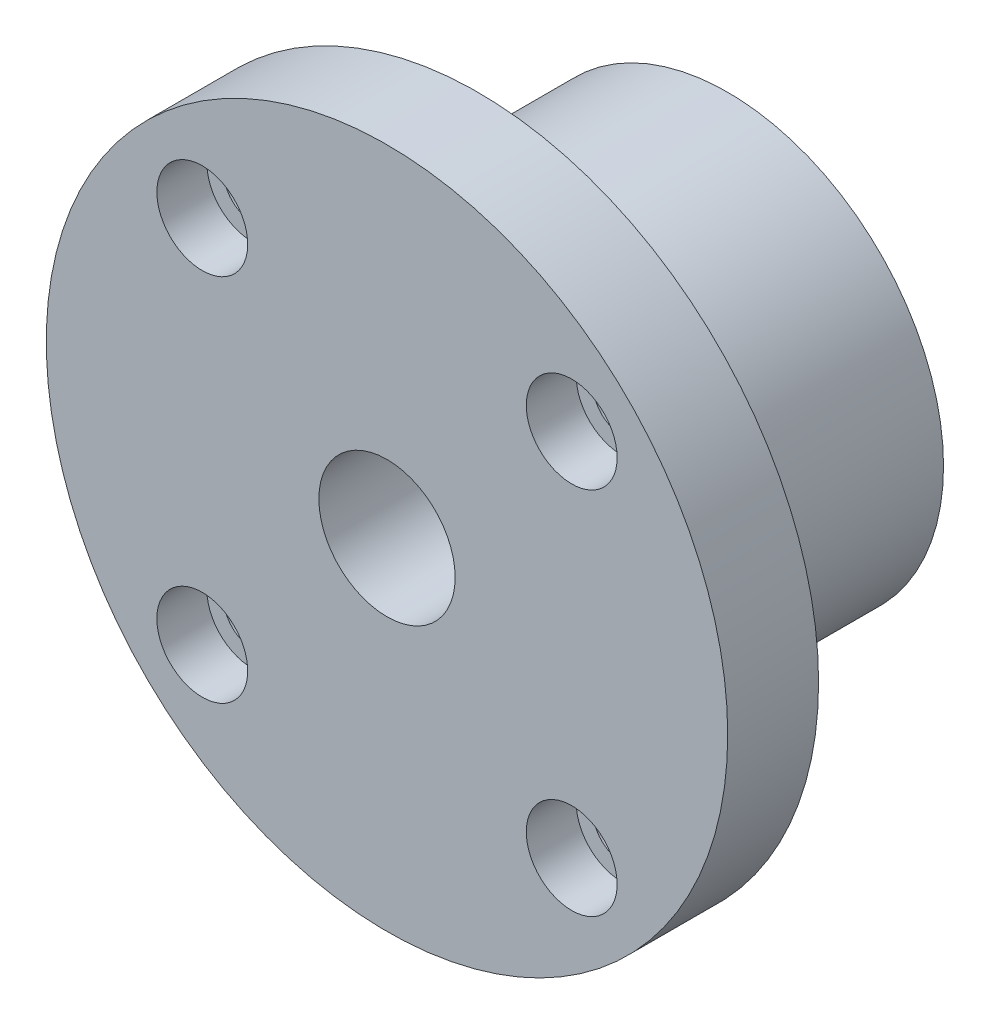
ISO-10303-21;
HEADER;
FILE_DESCRIPTION(('STEP AP214'),'2;1');
FILE_NAME('part.step','',(''),(''),'','','');
FILE_SCHEMA(('AUTOMOTIVE_DESIGN { 1 0 10303 214 1 1 1 1 }'));
ENDSEC;
DATA;
#1=APPLICATION_CONTEXT('core data for automotive mechanical design processes');
#2=APPLICATION_PROTOCOL_DEFINITION('international standard','automotive_design',2000,#1);
#3=PRODUCT_CONTEXT('',#1,'mechanical');
#4=PRODUCT('Part','Part','',(#3));
#5=PRODUCT_RELATED_PRODUCT_CATEGORY('part','',(#4));
#6=PRODUCT_DEFINITION_FORMATION('','',#4);
#7=PRODUCT_DEFINITION_CONTEXT('part definition',#1,'design');
#8=PRODUCT_DEFINITION('design','',#6,#7);
#9=PRODUCT_DEFINITION_SHAPE('','',#8);
#10=(LENGTH_UNIT() NAMED_UNIT(*) SI_UNIT(.MILLI.,.METRE.));
#11=(NAMED_UNIT(*) PLANE_ANGLE_UNIT() SI_UNIT($,.RADIAN.));
#12=(NAMED_UNIT(*) SI_UNIT($,.STERADIAN.) SOLID_ANGLE_UNIT());
#13=UNCERTAINTY_MEASURE_WITH_UNIT(LENGTH_MEASURE(1.E-05),#10,'distance_accuracy_value','');
#14=(GEOMETRIC_REPRESENTATION_CONTEXT(3) GLOBAL_UNCERTAINTY_ASSIGNED_CONTEXT((#13)) GLOBAL_UNIT_ASSIGNED_CONTEXT((#10,
#11,#12)) REPRESENTATION_CONTEXT('',''));
#15=CARTESIAN_POINT('',(0.,0.,0.));
#16=DIRECTION('',(0.,0.,1.));
#17=DIRECTION('',(1.,0.,0.));
#18=AXIS2_PLACEMENT_3D('',#15,#16,#17);
#19=CARTESIAN_POINT('',(0.,0.,0.));
#20=DIRECTION('',(0.,0.,1.));
#21=DIRECTION('',(1.,0.,0.));
#22=AXIS2_PLACEMENT_3D('',#19,#20,#21);
#23=PLANE('',#22);
#24=CARTESIAN_POINT('',(0.,0.,0.));
#25=DIRECTION('',(0.,0.,1.));
#26=DIRECTION('',(1.,0.,0.));
#27=AXIS2_PLACEMENT_3D('',#24,#25,#26);
#28=CIRCLE('',#27,30.);
#29=CARTESIAN_POINT('',(30.,0.,0.));
#30=VERTEX_POINT('',#29);
#31=EDGE_CURVE('E25',#30,#30,#28,.T.);
#32=ORIENTED_EDGE('',*,*,#31,.F.);
#33=EDGE_LOOP('',(#32));
#34=FACE_BOUND('',#33,.T.);
#35=CARTESIAN_POINT('',(16.2634559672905,16.2634559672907,0.));
#36=DIRECTION('',(0.,0.,1.));
#37=DIRECTION('',(1.,0.,0.));
#38=AXIS2_PLACEMENT_3D('',#35,#36,#37);
#39=CIRCLE('',#38,2.5);
#40=CARTESIAN_POINT('',(18.7634559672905,16.2634559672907,0.));
#41=VERTEX_POINT('',#40);
#42=EDGE_CURVE('E67',#41,#41,#39,.T.);
#43=ORIENTED_EDGE('',*,*,#42,.T.);
#44=EDGE_LOOP('',(#43));
#45=FACE_BOUND('',#44,.T.);
#46=CARTESIAN_POINT('',(16.2634559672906,-16.2634559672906,0.));
#47=DIRECTION('',(0.,0.,1.));
#48=DIRECTION('',(0.,-1.,0.));
#49=AXIS2_PLACEMENT_3D('',#46,#47,#48);
#50=CIRCLE('',#49,2.5);
#51=CARTESIAN_POINT('',(16.2634559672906,-18.7634559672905,0.));
#52=VERTEX_POINT('',#51);
#53=EDGE_CURVE('E57',#52,#52,#50,.T.);
#54=ORIENTED_EDGE('',*,*,#53,.T.);
#55=EDGE_LOOP('',(#54));
#56=FACE_BOUND('',#55,.T.);
#57=CARTESIAN_POINT('',(-16.2634559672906,-16.2634559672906,0.));
#58=DIRECTION('',(0.,0.,1.));
#59=DIRECTION('',(-1.,0.,0.));
#60=AXIS2_PLACEMENT_3D('',#57,#58,#59);
#61=CIRCLE('',#60,2.5);
#62=CARTESIAN_POINT('',(-18.7634559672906,-16.2634559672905,0.));
#63=VERTEX_POINT('',#62);
#64=EDGE_CURVE('E54',#63,#63,#61,.T.);
#65=ORIENTED_EDGE('',*,*,#64,.T.);
#66=EDGE_LOOP('',(#65));
#67=FACE_BOUND('',#66,.T.);
#68=CARTESIAN_POINT('',(-16.2634559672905,16.2634559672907,0.));
#69=DIRECTION('',(0.,0.,1.));
#70=DIRECTION('',(0.,1.,0.));
#71=AXIS2_PLACEMENT_3D('',#68,#69,#70);
#72=CIRCLE('',#71,2.5);
#73=CARTESIAN_POINT('',(-16.2634559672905,18.7634559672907,0.));
#74=VERTEX_POINT('',#73);
#75=EDGE_CURVE('E51',#74,#74,#72,.T.);
#76=ORIENTED_EDGE('',*,*,#75,.T.);
#77=EDGE_LOOP('',(#76));
#78=FACE_BOUND('',#77,.T.);
#79=CARTESIAN_POINT('',(0.,0.,0.));
#80=DIRECTION('',(0.,0.,1.));
#81=DIRECTION('',(1.,0.,0.));
#82=AXIS2_PLACEMENT_3D('',#79,#80,#81);
#83=CIRCLE('',#82,19.);
#84=CARTESIAN_POINT('',(19.,0.,0.));
#85=VERTEX_POINT('',#84);
#86=EDGE_CURVE('E8',#85,#85,#83,.F.);
#87=ORIENTED_EDGE('',*,*,#86,.F.);
#88=EDGE_LOOP('',(#87));
#89=FACE_BOUND('',#88,.T.);
#90=ADVANCED_FACE('F12',(#34,#45,#56,#67,#78,#89),#23,.F.);
#91=CARTESIAN_POINT('',(-16.2634559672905,16.2634559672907,0.));
#92=DIRECTION('',(0.,0.,1.));
#93=DIRECTION('',(1.,0.,0.));
#94=AXIS2_PLACEMENT_3D('',#91,#92,#93);
#95=CYLINDRICAL_SURFACE('',#94,2.5);
#96=ORIENTED_EDGE('',*,*,#75,.F.);
#97=EDGE_LOOP('',(#96));
#98=FACE_BOUND('',#97,.T.);
#99=CARTESIAN_POINT('',(-16.2634559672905,16.2634559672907,3.6));
#100=DIRECTION('',(0.,0.,1.));
#101=DIRECTION('',(1.,0.,0.));
#102=AXIS2_PLACEMENT_3D('',#99,#100,#101);
#103=CIRCLE('',#102,2.5);
#104=CARTESIAN_POINT('',(-13.7634559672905,16.2634559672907,3.6));
#105=VERTEX_POINT('',#104);
#106=EDGE_CURVE('E16',#105,#105,#103,.F.);
#107=ORIENTED_EDGE('',*,*,#106,.F.);
#108=EDGE_LOOP('',(#107));
#109=FACE_BOUND('',#108,.T.);
#110=ADVANCED_FACE('F86',(#98,#109),#95,.F.);
#111=CARTESIAN_POINT('',(-16.2634559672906,-16.2634559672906,0.));
#112=DIRECTION('',(0.,0.,1.));
#113=DIRECTION('',(1.,0.,0.));
#114=AXIS2_PLACEMENT_3D('',#111,#112,#113);
#115=CYLINDRICAL_SURFACE('',#114,2.5);
#116=ORIENTED_EDGE('',*,*,#64,.F.);
#117=EDGE_LOOP('',(#116));
#118=FACE_BOUND('',#117,.T.);
#119=CARTESIAN_POINT('',(-16.2634559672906,-16.2634559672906,3.6));
#120=DIRECTION('',(0.,0.,1.));
#121=DIRECTION('',(1.,0.,0.));
#122=AXIS2_PLACEMENT_3D('',#119,#120,#121);
#123=CIRCLE('',#122,2.5);
#124=CARTESIAN_POINT('',(-13.7634559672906,-16.2634559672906,3.6));
#125=VERTEX_POINT('',#124);
#126=EDGE_CURVE('E43',#125,#125,#123,.F.);
#127=ORIENTED_EDGE('',*,*,#126,.F.);
#128=EDGE_LOOP('',(#127));
#129=FACE_BOUND('',#128,.T.);
#130=ADVANCED_FACE('F83',(#118,#129),#115,.F.);
#131=CARTESIAN_POINT('',(16.2634559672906,-16.2634559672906,0.));
#132=DIRECTION('',(0.,0.,1.));
#133=DIRECTION('',(1.,0.,0.));
#134=AXIS2_PLACEMENT_3D('',#131,#132,#133);
#135=CYLINDRICAL_SURFACE('',#134,2.5);
#136=ORIENTED_EDGE('',*,*,#53,.F.);
#137=EDGE_LOOP('',(#136));
#138=FACE_BOUND('',#137,.T.);
#139=CARTESIAN_POINT('',(16.2634559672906,-16.2634559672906,3.6));
#140=DIRECTION('',(0.,0.,1.));
#141=DIRECTION('',(1.,0.,0.));
#142=AXIS2_PLACEMENT_3D('',#139,#140,#141);
#143=CIRCLE('',#142,2.5);
#144=CARTESIAN_POINT('',(18.7634559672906,-16.2634559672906,3.6));
#145=VERTEX_POINT('',#144);
#146=EDGE_CURVE('E50',#145,#145,#143,.F.);
#147=ORIENTED_EDGE('',*,*,#146,.F.);
#148=EDGE_LOOP('',(#147));
#149=FACE_BOUND('',#148,.T.);
#150=ADVANCED_FACE('F85',(#138,#149),#135,.F.);
#151=CARTESIAN_POINT('',(16.2634559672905,16.2634559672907,0.));
#152=DIRECTION('',(0.,0.,1.));
#153=DIRECTION('',(1.,0.,0.));
#154=AXIS2_PLACEMENT_3D('',#151,#152,#153);
#155=CYLINDRICAL_SURFACE('',#154,2.5);
#156=ORIENTED_EDGE('',*,*,#42,.F.);
#157=EDGE_LOOP('',(#156));
#158=FACE_BOUND('',#157,.T.);
#159=CARTESIAN_POINT('',(16.2634559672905,16.2634559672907,3.6));
#160=DIRECTION('',(0.,0.,1.));
#161=DIRECTION('',(1.,0.,0.));
#162=AXIS2_PLACEMENT_3D('',#159,#160,#161);
#163=CIRCLE('',#162,2.5);
#164=CARTESIAN_POINT('',(18.7634559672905,16.2634559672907,3.6));
#165=VERTEX_POINT('',#164);
#166=EDGE_CURVE('E66',#165,#165,#163,.F.);
#167=ORIENTED_EDGE('',*,*,#166,.F.);
#168=EDGE_LOOP('',(#167));
#169=FACE_BOUND('',#168,.T.);
#170=ADVANCED_FACE('F94',(#158,#169),#155,.F.);
#171=CARTESIAN_POINT('',(0.,0.,8.));
#172=DIRECTION('',(0.,0.,1.));
#173=DIRECTION('',(1.,0.,0.));
#174=AXIS2_PLACEMENT_3D('',#171,#172,#173);
#175=PLANE('',#174);
#176=CARTESIAN_POINT('',(-16.2634559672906,-16.2634559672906,8.));
#177=DIRECTION('',(0.,0.,1.));
#178=DIRECTION('',(-1.,0.,0.));
#179=AXIS2_PLACEMENT_3D('',#176,#177,#178);
#180=CIRCLE('',#179,4.);
#181=CARTESIAN_POINT('',(-20.2634559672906,-16.2634559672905,8.));
#182=VERTEX_POINT('',#181);
#183=EDGE_CURVE('E37',#182,#182,#180,.T.);
#184=ORIENTED_EDGE('',*,*,#183,.F.);
#185=EDGE_LOOP('',(#184));
#186=FACE_BOUND('',#185,.T.);
#187=CARTESIAN_POINT('',(-16.2634559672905,16.2634559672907,8.));
#188=DIRECTION('',(0.,0.,1.));
#189=DIRECTION('',(0.,1.,0.));
#190=AXIS2_PLACEMENT_3D('',#187,#188,#189);
#191=CIRCLE('',#190,4.);
#192=CARTESIAN_POINT('',(-16.2634559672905,20.2634559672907,8.));
#193=VERTEX_POINT('',#192);
#194=EDGE_CURVE('E31',#193,#193,#191,.T.);
#195=ORIENTED_EDGE('',*,*,#194,.F.);
#196=EDGE_LOOP('',(#195));
#197=FACE_BOUND('',#196,.T.);
#198=CARTESIAN_POINT('',(16.2634559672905,16.2634559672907,8.));
#199=DIRECTION('',(0.,0.,1.));
#200=DIRECTION('',(1.,0.,0.));
#201=AXIS2_PLACEMENT_3D('',#198,#199,#200);
#202=CIRCLE('',#201,4.);
#203=CARTESIAN_POINT('',(20.2634559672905,16.2634559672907,8.));
#204=VERTEX_POINT('',#203);
#205=EDGE_CURVE('E60',#204,#204,#202,.T.);
#206=ORIENTED_EDGE('',*,*,#205,.F.);
#207=EDGE_LOOP('',(#206));
#208=FACE_BOUND('',#207,.T.);
#209=CARTESIAN_POINT('',(16.2634559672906,-16.2634559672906,8.));
#210=DIRECTION('',(0.,0.,1.));
#211=DIRECTION('',(0.,-1.,0.));
#212=AXIS2_PLACEMENT_3D('',#209,#210,#211);
#213=CIRCLE('',#212,4.);
#214=CARTESIAN_POINT('',(16.2634559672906,-20.2634559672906,8.));
#215=VERTEX_POINT('',#214);
#216=EDGE_CURVE('E44',#215,#215,#213,.T.);
#217=ORIENTED_EDGE('',*,*,#216,.F.);
#218=EDGE_LOOP('',(#217));
#219=FACE_BOUND('',#218,.T.);
#220=CARTESIAN_POINT('',(0.,0.,8.));
#221=DIRECTION('',(0.,0.,1.));
#222=DIRECTION('',(1.,0.,0.));
#223=AXIS2_PLACEMENT_3D('',#220,#221,#222);
#224=CIRCLE('',#223,6.);
#225=CARTESIAN_POINT('',(6.,0.,8.));
#226=VERTEX_POINT('',#225);
#227=EDGE_CURVE('E70',#226,#226,#224,.T.);
#228=ORIENTED_EDGE('',*,*,#227,.F.);
#229=EDGE_LOOP('',(#228));
#230=FACE_BOUND('',#229,.T.);
#231=CARTESIAN_POINT('',(0.,0.,8.));
#232=DIRECTION('',(0.,0.,1.));
#233=DIRECTION('',(1.,0.,0.));
#234=AXIS2_PLACEMENT_3D('',#231,#232,#233);
#235=CIRCLE('',#234,30.);
#236=CARTESIAN_POINT('',(30.,0.,8.));
#237=VERTEX_POINT('',#236);
#238=EDGE_CURVE('E20',#237,#237,#235,.T.);
#239=ORIENTED_EDGE('',*,*,#238,.T.);
#240=EDGE_LOOP('',(#239));
#241=FACE_BOUND('',#240,.T.);
#242=ADVANCED_FACE('F110',(#186,#197,#208,#219,#230,#241),#175,.T.);
#243=CARTESIAN_POINT('',(0.,0.,8.));
#244=DIRECTION('',(0.,0.,-1.));
#245=DIRECTION('',(-1.,0.,0.));
#246=AXIS2_PLACEMENT_3D('',#243,#244,#245);
#247=CYLINDRICAL_SURFACE('',#246,30.);
#248=ORIENTED_EDGE('',*,*,#238,.F.);
#249=EDGE_LOOP('',(#248));
#250=FACE_BOUND('',#249,.T.);
#251=ORIENTED_EDGE('',*,*,#31,.T.);
#252=EDGE_LOOP('',(#251));
#253=FACE_BOUND('',#252,.T.);
#254=ADVANCED_FACE('F14',(#250,#253),#247,.T.);
#255=CARTESIAN_POINT('',(0.,0.,8.));
#256=DIRECTION('',(0.,0.,-1.));
#257=DIRECTION('',(-1.,0.,0.));
#258=AXIS2_PLACEMENT_3D('',#255,#256,#257);
#259=CYLINDRICAL_SURFACE('',#258,6.);
#260=ORIENTED_EDGE('',*,*,#227,.T.);
#261=EDGE_LOOP('',(#260));
#262=FACE_BOUND('',#261,.T.);
#263=CARTESIAN_POINT('',(0.,0.,-22.));
#264=DIRECTION('',(0.,0.,-1.));
#265=DIRECTION('',(-1.,0.,0.));
#266=AXIS2_PLACEMENT_3D('',#263,#264,#265);
#267=CIRCLE('',#266,6.);
#268=CARTESIAN_POINT('',(-6.,0.,-22.));
#269=VERTEX_POINT('',#268);
#270=EDGE_CURVE('E137',#269,#269,#267,.T.);
#271=ORIENTED_EDGE('',*,*,#270,.T.);
#272=EDGE_LOOP('',(#271));
#273=FACE_BOUND('',#272,.T.);
#274=ADVANCED_FACE('F108',(#262,#273),#259,.F.);
#275=CARTESIAN_POINT('',(16.2634559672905,16.2634559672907,3.6));
#276=DIRECTION('',(0.,0.,1.));
#277=DIRECTION('',(1.,0.,0.));
#278=AXIS2_PLACEMENT_3D('',#275,#276,#277);
#279=PLANE('',#278);
#280=CARTESIAN_POINT('',(16.2634559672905,16.2634559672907,3.6));
#281=DIRECTION('',(0.,0.,1.));
#282=DIRECTION('',(1.,0.,0.));
#283=AXIS2_PLACEMENT_3D('',#280,#281,#282);
#284=CIRCLE('',#283,4.);
#285=CARTESIAN_POINT('',(20.2634559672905,16.2634559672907,3.6));
#286=VERTEX_POINT('',#285);
#287=EDGE_CURVE('E63',#286,#286,#284,.T.);
#288=ORIENTED_EDGE('',*,*,#287,.T.);
#289=EDGE_LOOP('',(#288));
#290=FACE_BOUND('',#289,.T.);
#291=ORIENTED_EDGE('',*,*,#166,.T.);
#292=EDGE_LOOP('',(#291));
#293=FACE_BOUND('',#292,.T.);
#294=ADVANCED_FACE('F134',(#290,#293),#279,.T.);
#295=CARTESIAN_POINT('',(16.2634559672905,16.2634559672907,3.6));
#296=DIRECTION('',(0.,0.,1.));
#297=DIRECTION('',(1.,0.,0.));
#298=AXIS2_PLACEMENT_3D('',#295,#296,#297);
#299=CYLINDRICAL_SURFACE('',#298,4.);
#300=ORIENTED_EDGE('',*,*,#205,.T.);
#301=EDGE_LOOP('',(#300));
#302=FACE_BOUND('',#301,.T.);
#303=ORIENTED_EDGE('',*,*,#287,.F.);
#304=EDGE_LOOP('',(#303));
#305=FACE_BOUND('',#304,.T.);
#306=ADVANCED_FACE('F171',(#302,#305),#299,.F.);
#307=CARTESIAN_POINT('',(16.2634559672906,-16.2634559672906,3.6));
#308=DIRECTION('',(0.,0.,1.));
#309=DIRECTION('',(0.,-1.,0.));
#310=AXIS2_PLACEMENT_3D('',#307,#308,#309);
#311=PLANE('',#310);
#312=CARTESIAN_POINT('',(16.2634559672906,-16.2634559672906,3.6));
#313=DIRECTION('',(0.,0.,1.));
#314=DIRECTION('',(0.,-1.,0.));
#315=AXIS2_PLACEMENT_3D('',#312,#313,#314);
#316=CIRCLE('',#315,4.);
#317=CARTESIAN_POINT('',(16.2634559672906,-20.2634559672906,3.6));
#318=VERTEX_POINT('',#317);
#319=EDGE_CURVE('E47',#318,#318,#316,.T.);
#320=ORIENTED_EDGE('',*,*,#319,.T.);
#321=EDGE_LOOP('',(#320));
#322=FACE_BOUND('',#321,.T.);
#323=ORIENTED_EDGE('',*,*,#146,.T.);
#324=EDGE_LOOP('',(#323));
#325=FACE_BOUND('',#324,.T.);
#326=ADVANCED_FACE('F168',(#322,#325),#311,.T.);
#327=CARTESIAN_POINT('',(16.2634559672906,-16.2634559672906,3.6));
#328=DIRECTION('',(0.,0.,1.));
#329=DIRECTION('',(1.,0.,0.));
#330=AXIS2_PLACEMENT_3D('',#327,#328,#329);
#331=CYLINDRICAL_SURFACE('',#330,4.);
#332=ORIENTED_EDGE('',*,*,#216,.T.);
#333=EDGE_LOOP('',(#332));
#334=FACE_BOUND('',#333,.T.);
#335=ORIENTED_EDGE('',*,*,#319,.F.);
#336=EDGE_LOOP('',(#335));
#337=FACE_BOUND('',#336,.T.);
#338=ADVANCED_FACE('F163',(#334,#337),#331,.F.);
#339=CARTESIAN_POINT('',(-16.2634559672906,-16.2634559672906,3.6));
#340=DIRECTION('',(0.,0.,1.));
#341=DIRECTION('',(-1.,0.,0.));
#342=AXIS2_PLACEMENT_3D('',#339,#340,#341);
#343=PLANE('',#342);
#344=CARTESIAN_POINT('',(-16.2634559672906,-16.2634559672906,3.6));
#345=DIRECTION('',(0.,0.,1.));
#346=DIRECTION('',(-1.,0.,0.));
#347=AXIS2_PLACEMENT_3D('',#344,#345,#346);
#348=CIRCLE('',#347,4.);
#349=CARTESIAN_POINT('',(-20.2634559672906,-16.2634559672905,3.6));
#350=VERTEX_POINT('',#349);
#351=EDGE_CURVE('E40',#350,#350,#348,.T.);
#352=ORIENTED_EDGE('',*,*,#351,.T.);
#353=EDGE_LOOP('',(#352));
#354=FACE_BOUND('',#353,.T.);
#355=ORIENTED_EDGE('',*,*,#126,.T.);
#356=EDGE_LOOP('',(#355));
#357=FACE_BOUND('',#356,.T.);
#358=ADVANCED_FACE('F81',(#354,#357),#343,.T.);
#359=CARTESIAN_POINT('',(-16.2634559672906,-16.2634559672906,3.6));
#360=DIRECTION('',(0.,0.,1.));
#361=DIRECTION('',(1.,0.,0.));
#362=AXIS2_PLACEMENT_3D('',#359,#360,#361);
#363=CYLINDRICAL_SURFACE('',#362,4.);
#364=ORIENTED_EDGE('',*,*,#183,.T.);
#365=EDGE_LOOP('',(#364));
#366=FACE_BOUND('',#365,.T.);
#367=ORIENTED_EDGE('',*,*,#351,.F.);
#368=EDGE_LOOP('',(#367));
#369=FACE_BOUND('',#368,.T.);
#370=ADVANCED_FACE('F158',(#366,#369),#363,.F.);
#371=CARTESIAN_POINT('',(-16.2634559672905,16.2634559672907,3.6));
#372=DIRECTION('',(0.,0.,1.));
#373=DIRECTION('',(0.,1.,0.));
#374=AXIS2_PLACEMENT_3D('',#371,#372,#373);
#375=PLANE('',#374);
#376=CARTESIAN_POINT('',(-16.2634559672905,16.2634559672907,3.6));
#377=DIRECTION('',(0.,0.,1.));
#378=DIRECTION('',(0.,1.,0.));
#379=AXIS2_PLACEMENT_3D('',#376,#377,#378);
#380=CIRCLE('',#379,4.);
#381=CARTESIAN_POINT('',(-16.2634559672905,20.2634559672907,3.6));
#382=VERTEX_POINT('',#381);
#383=EDGE_CURVE('E34',#382,#382,#380,.T.);
#384=ORIENTED_EDGE('',*,*,#383,.T.);
#385=EDGE_LOOP('',(#384));
#386=FACE_BOUND('',#385,.T.);
#387=ORIENTED_EDGE('',*,*,#106,.T.);
#388=EDGE_LOOP('',(#387));
#389=FACE_BOUND('',#388,.T.);
#390=ADVANCED_FACE('F153',(#386,#389),#375,.T.);
#391=CARTESIAN_POINT('',(-16.2634559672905,16.2634559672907,3.6));
#392=DIRECTION('',(0.,0.,1.));
#393=DIRECTION('',(1.,0.,0.));
#394=AXIS2_PLACEMENT_3D('',#391,#392,#393);
#395=CYLINDRICAL_SURFACE('',#394,4.);
#396=ORIENTED_EDGE('',*,*,#194,.T.);
#397=EDGE_LOOP('',(#396));
#398=FACE_BOUND('',#397,.T.);
#399=ORIENTED_EDGE('',*,*,#383,.F.);
#400=EDGE_LOOP('',(#399));
#401=FACE_BOUND('',#400,.T.);
#402=ADVANCED_FACE('F146',(#398,#401),#395,.F.);
#403=CARTESIAN_POINT('',(0.,0.,-22.));
#404=DIRECTION('',(0.,0.,1.));
#405=DIRECTION('',(1.,0.,0.));
#406=AXIS2_PLACEMENT_3D('',#403,#404,#405);
#407=CYLINDRICAL_SURFACE('',#406,19.);
#408=CARTESIAN_POINT('',(0.,0.,-22.));
#409=DIRECTION('',(0.,0.,-1.));
#410=DIRECTION('',(-1.,0.,0.));
#411=AXIS2_PLACEMENT_3D('',#408,#409,#410);
#412=CIRCLE('',#411,19.);
#413=CARTESIAN_POINT('',(-19.,0.,-22.));
#414=VERTEX_POINT('',#413);
#415=EDGE_CURVE('E29',#414,#414,#412,.T.);
#416=ORIENTED_EDGE('',*,*,#415,.F.);
#417=EDGE_LOOP('',(#416));
#418=FACE_BOUND('',#417,.T.);
#419=ORIENTED_EDGE('',*,*,#86,.T.);
#420=EDGE_LOOP('',(#419));
#421=FACE_BOUND('',#420,.T.);
#422=ADVANCED_FACE('F144',(#418,#421),#407,.T.);
#423=CARTESIAN_POINT('',(0.,0.,-22.));
#424=DIRECTION('',(0.,0.,-1.));
#425=DIRECTION('',(-1.,0.,0.));
#426=AXIS2_PLACEMENT_3D('',#423,#424,#425);
#427=PLANE('',#426);
#428=ORIENTED_EDGE('',*,*,#415,.T.);
#429=EDGE_LOOP('',(#428));
#430=FACE_BOUND('',#429,.T.);
#431=ORIENTED_EDGE('',*,*,#270,.F.);
#432=EDGE_LOOP('',(#431));
#433=FACE_BOUND('',#432,.T.);
#434=ADVANCED_FACE('F142',(#430,#433),#427,.T.);
#435=CLOSED_SHELL('',(#90,#110,#130,#150,#170,#242,#254,#274,#294,#306,#326,#338,#358,#370,#390,
#402,#422,#434));
#436=MANIFOLD_SOLID_BREP('B1',#435);
#437=ADVANCED_BREP_SHAPE_REPRESENTATION('',(#18,#436),#14);
#438=SHAPE_DEFINITION_REPRESENTATION(#9,#437);
ENDSEC;
END-ISO-10303-21;
